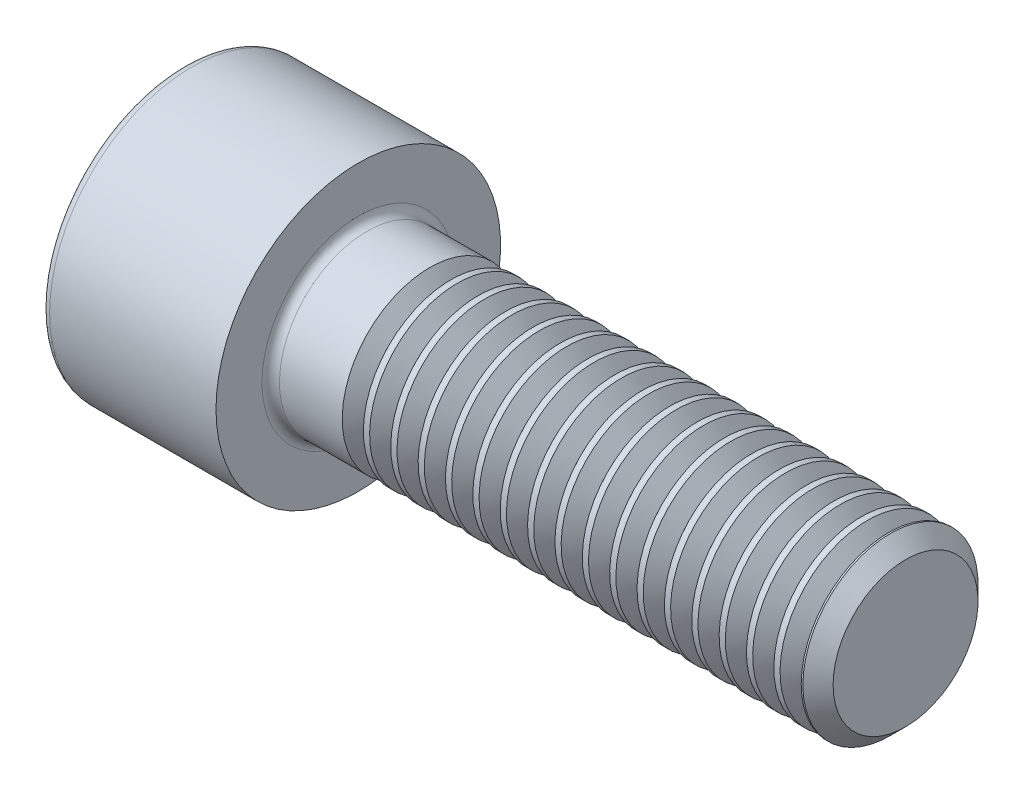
from build123d import *

# Parameters (mm, degrees)
FILLET1_R       = 0.4
FILLET2_R       = 0.4
HEX_2_DEPTH     = 4
THDSCHPAT_COUNT = 17
THDSCHPAT_PITCH = 1.25


with BuildPart() as part:
    # BodySke → Base-Revolve (revolve)
    with BuildSketch(Plane.XY, mode=Mode.PRIVATE) as base_revolve_sk:
        Polygon((0, 0), (0, 6.5), (8, 6.5), (8, 4), (32.3095, 4), (33, 3.3095), (33, 0), align=None)
    revolve(base_revolve_sk.sketch.rotate(Axis((-31.75, 0, 0), (1, 0, 0)), 90), axis=Axis((-31.75, 0, 0), (1, 0, 0)))

    # Fillet1
    fillet1_edges = [part.edges().sort_by_distance(p)[0] for p in [
        (8, 0, -4),
    ]]
    fillet(fillet1_edges, radius=FILLET1_R)

    # Fillet2
    fillet2_edges = [part.edges().sort_by_distance(p)[0] for p in [
        (0, 0, -6.5),
    ]]
    fillet(fillet2_edges, radius=FILLET2_R)

    # Sketch2 → Hex-PreBroach (revolve, cut)
    with BuildSketch(Plane.XY, mode=Mode.PRIVATE) as hex_prebroach_sk:
        Polygon((0, 3.0475), (4, 3.0475), (5.759474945, 0), (0, 0), align=None)
    revolve(hex_prebroach_sk.sketch.rotate(Axis((0, 0, 0), (1, 0, 0)), 90), axis=Axis((0, 0, 0), (1, 0, 0)), mode=Mode.SUBTRACT)

    # Sketch3 → Hex 2 (cut)
    with BuildSketch(Plane(origin=(0, 0, 0), x_dir=(0, 0.500000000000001, 0.866025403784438), z_dir=(-1, 0, 0))):
        Polygon((1.759474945, 3.0475), (-1.759474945, 3.0475), (-3.518949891, 0), (-1.759474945, -3.0475), (1.759474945, -3.0475), (3.518949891, 0), align=None)
    extrude(amount=-HEX_2_DEPTH, mode=Mode.SUBTRACT)

    # ThdSchSke → ThreadSchematic (revolve, cut)
    with BuildSketch(Plane.XY):
        Polygon((11.75, -3.3095), (11.266506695, -4), (11.266506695, -5), (12.233493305, -5), (12.233493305, -4), align=None)
    threadschematic = revolve(axis=Axis((-3.175, 0, 0), (1, 0, 0)), mode=Mode.SUBTRACT)

    # ThdSchPat: ThreadSchematic ×17
    with Locations(*[(i * THDSCHPAT_PITCH, 0, 0) for i in range(1, THDSCHPAT_COUNT)]):
        add(threadschematic, mode=Mode.SUBTRACT)


solid = part.part
